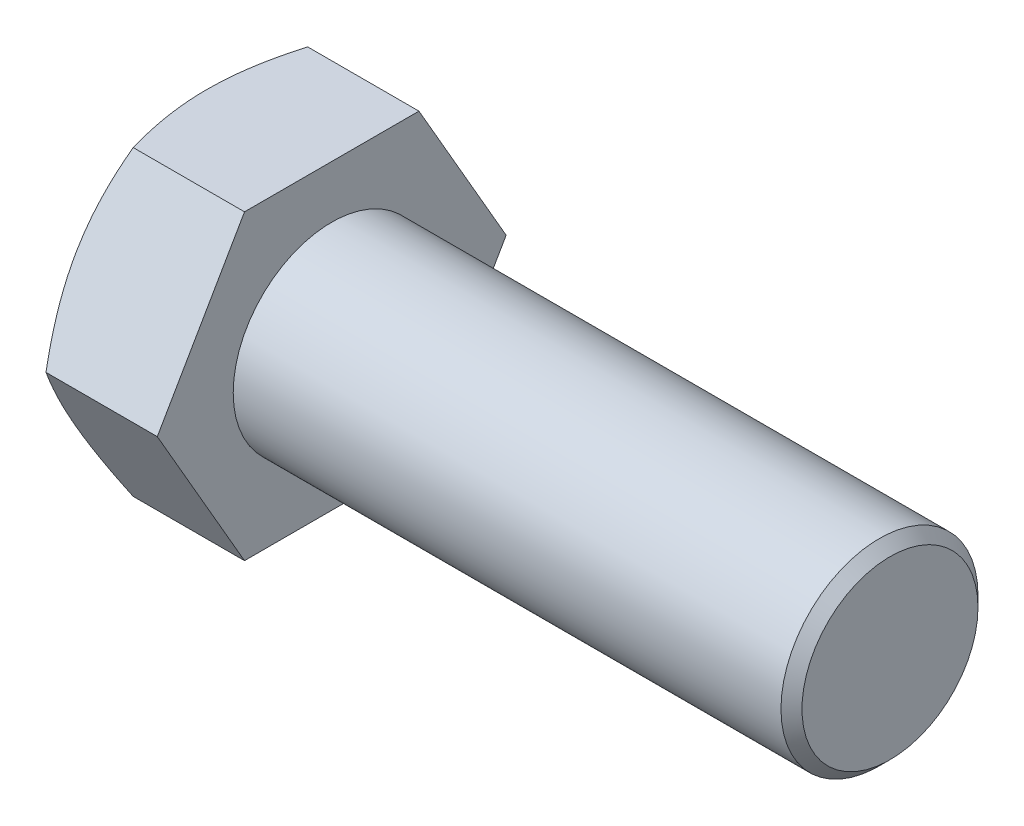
from build123d import *

# Parameters (mm, degrees)
ESQUISSE1_W        = 85
ESQUISSE1_H        = 15
CHANFREIN1_SIZE    = 1.6
BOSS_EXTRU_1_DEPTH = 19


with BuildPart() as part:
    # Esquisse1 → Base-R_volution (revolve)
    with BuildSketch(Plane(origin=(0, 0, 0), x_dir=(1, 0, 0), z_dir=(0, 1, 0)), mode=Mode.PRIVATE) as base_r_volution_sk:
        with Locations((42.5, 7.5)):
            Rectangle(ESQUISSE1_W, ESQUISSE1_H)
    revolve(base_r_volution_sk.sketch.rotate(Axis((0, 0, 0), (1, 0, 0)), 180), axis=Axis((0, 0, 0), (1, 0, 0)))

    # Chanfrein1
    chanfrein1_edges = [part.edges().sort_by_distance(p)[0] for p in [
        (85, 0, -15),
    ]]
    chamfer(chanfrein1_edges, length=CHANFREIN1_SIZE)

    # Esquisse6 → Boss.-Extru.1 (add)
    with BuildSketch(Plane(origin=(0, 0, 0), x_dir=(0, -1, 0), z_dir=(1, 0, 0))):
        Polygon((23, -13.279056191), (23, 13.279056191), (0, 26.558112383), (-23, 13.279056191), (-23, -13.279056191), (0, -26.558112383), align=None)
    extrude(amount=-BOSS_EXTRU_1_DEPTH)

    # Esquisse7 → Enlever de la mati_re-R_volution1 (revolve, cut)
    with BuildSketch(Plane.XY, mode=Mode.PRIVATE) as enlever_de_la_mati_re_r_volution1_sk:
        Polygon((-19, 23), (-19, 55.908965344), (0, 55.908965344), align=None)
    revolve(enlever_de_la_mati_re_r_volution1_sk.sketch.rotate(Axis((0, 0, 0), (-1, 0, 0)), 90), axis=Axis((0, 0, 0), (-1, 0, 0)), mode=Mode.SUBTRACT)


solid = part.part
